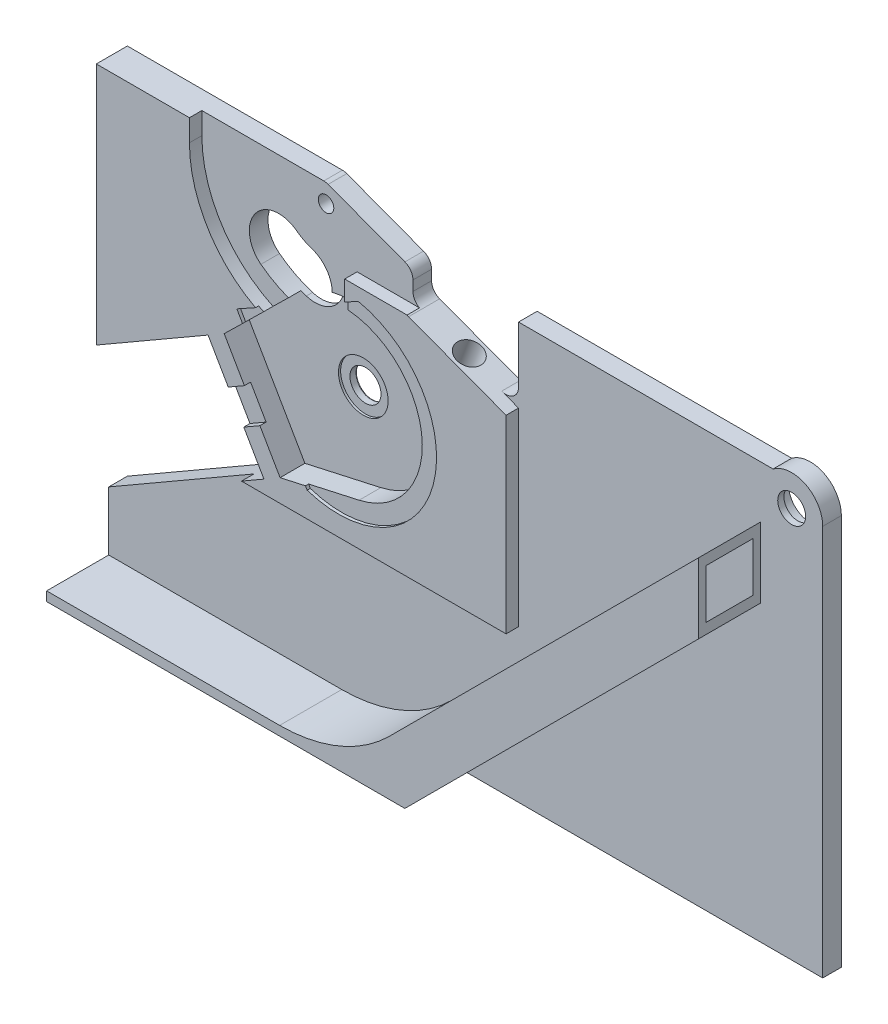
from build123d import *

# Parameters (mm, degrees)
BOSS_EXTRU_1_DEPTH       = 3
BOSS_EXTRU_2_DEPTH       = 10
ESQUISSE3_W              = 7.6
ESQUISSE3_H              = 5.6
ENL_V_MAT_EXTRU_1_DEPTH  = 50
ENL_V_MAT_EXTRU_2_DEPTH  = 7.6
ENL_V_MAT_EXTRU_3_DEPTH  = 10
BOSS_EXTRU_4_DEPTH       = 2
ESQUISSE10_R             = 2.5
ENL_V_MAT_EXTRU_5_DEPTH  = 136.388330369
ENL_V_MAT_EXTRU_6_DEPTH  = 2
TROU_TARAUD_M31_D        = 2.5
ENL_V_MAT_EXTRU_7_DEPTH  = 10
ENL_V_MAT_EXTRU_9_DEPTH  = 10
CONG_3_R                 = 2
ENL_V_MAT_EXTRU_10_DEPTH = 4
ESQUISSE23_R             = 4
ESQUISSE23_R_2           = 2.5
ENL_V_MAT_EXTRU_14_DEPTH = 0.35
ESQUISSE24_R             = 7
ESQUISSE24_R_2           = 2.5
BOSS_EXTRU_7_DEPTH       = 0.5
CONG_4_R                 = 0.2
ESQUISSE27_R             = 5
BOSS_EXTRU_8_DEPTH       = 3
ESQUISSE28_R             = 3.5
ENL_V_MAT_EXTRU_16_DEPTH = 2
ESQUISSE29_R             = 2.25
ENL_V_MAT_EXTRU_17_DEPTH = 2
ENL_V_MAT_EXTRU_18_DEPTH = 136.775550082
ENL_V_MAT_EXTRU_24_DEPTH = 0.5
ESQUISSE37_R             = 2
ENL_V_MAT_EXTRU_25_DEPTH = 6
ENL_V_MAT_EXTRU_26_DEPTH = 1


with BuildPart() as part:
    # Esquisse1 → Boss.-Extru.1 (new body)
    with BuildSketch(Plane.XY):
        Polygon((0, 0), (115, 0), (115, 67), (60, 67), (60, 71), (0, 71), (0, 67), align=None)
    extrude(amount=BOSS_EXTRU_1_DEPTH)

    # Esquisse2 → Boss.-Extru.2 (add)
    with BuildSketch(Plane.XY.offset(3)):
        with BuildLine():
            Line((105, 58.613708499), (105, 47.3))
            Line((105, 47.3), (57.7, 0))
            Line((57.7, 0), (49.300505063, 0))
            Line((49.300505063, 0), (0, 0))
            Line((0, 0), (0, 1.5))
            Line((0, 1.5), (37.530952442, 1.5))
            ThreePointArc((37.530952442, 1.5), (47.098038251, 3.403011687), (55.208621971, 8.82233047))
            Line((55.208621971, 8.82233047), (105, 58.613708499))
        make_face()
    extrude(amount=BOSS_EXTRU_2_DEPTH)

    # Esquisse3 → Enl_v. mat.-Extru.1 (cut, symmetric)
    with BuildSketch(Plane(origin=(112.071067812, 2.928932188, 0), x_dir=(0, 0, -1), z_dir=(0.7071067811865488, 0.7071067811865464, 0))):
        with Locations((-8, 40.375082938)):
            Rectangle(ESQUISSE3_W, ESQUISSE3_H)
    extrude(amount=ENL_V_MAT_EXTRU_1_DEPTH, both=True, mode=Mode.SUBTRACT)

    # Esquisse5 → Enl_v. mat.-Extru.2 (cut)
    with BuildSketch(Plane.XY.offset(4.2)):
        with BuildLine():
            Line((55.405678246, 7.32233047), (48.083347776, 0))
            Line((48.083347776, 0), (37.728008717, 0))
            ThreePointArc((37.728008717, 0), (47.295094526, 1.903011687), (55.405678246, 7.32233047))
        make_face()
    extrude(amount=ENL_V_MAT_EXTRU_2_DEPTH, mode=Mode.SUBTRACT)

    # Esquisse6 → Enl_v. mat.-Extru.3 (cut)
    with BuildSketch(Plane.XY.offset(3)):
        Polygon((0, 11), (27, 26.588457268), (18, 42.176914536), (0, 31.784609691), align=None)
    extrude(amount=-ENL_V_MAT_EXTRU_3_DEPTH, mode=Mode.SUBTRACT)

    # Esquisse7 → Boss.-Extru.4 (add)
    with BuildSketch(Plane.XY.offset(3)):
        Polygon((23.382685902, 24.5), (66, 24.5), (66, 55), (50, 61), (21, 61), (21, 71), (0, 71), (0, 60), (0, 31.784609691), (18, 42.176914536), (27, 26.588457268), align=None)
    extrude(amount=BOSS_EXTRU_4_DEPTH)

    # Esquisse10 → Enl_v. mat.-Extru.5 (cut, through all)
    with BuildSketch(Plane.XY.offset(5)):
        with Locations((39, 43.5)):
            Circle(ESQUISSE10_R)
    extrude(amount=-ENL_V_MAT_EXTRU_5_DEPTH, mode=Mode.SUBTRACT)

    # Esquisse13 → Enl_v. mat.-Extru.6 (cut)
    with BuildSketch(Plane.XY.offset(5)):
        with BuildLine():
            Line((40, 71), (40, 48.135083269))
            ThreePointArc((40, 48.135083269), (22.752551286, 51.688611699), (15, 67.5))
            Line((15, 67.5), (15, 71))
            Line((15, 71), (40, 71))
        make_face()
    extrude(amount=-ENL_V_MAT_EXTRU_6_DEPTH, mode=Mode.SUBTRACT)

    # Trou taraud_ M31 (through all)
    with Locations(Plane.XY.offset(3)):
        with Locations((35, 68)):
            Hole(TROU_TARAUD_M31_D / 2)

    # Esquisse18 → Enl_v. mat.-Extru.7 (cut)
    with BuildSketch(Plane.XY.offset(3)):
        with BuildLine():
            ThreePointArc((24.508994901, 54.306888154), (27.04616076, 52.693173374), (29.825, 51.544548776))
            ThreePointArc((29.825, 51.544548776), (35.781211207, 54.650759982), (32.675, 60.606971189))
            ThreePointArc((32.675, 60.606971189), (31.426535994, 61.123019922), (30.286649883, 61.848022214))
            ThreePointArc((30.286649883, 61.848022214), (23.627255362, 60.966282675), (24.508994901, 54.306888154))
        make_face()
    extrude(amount=-ENL_V_MAT_EXTRU_7_DEPTH, mode=Mode.SUBTRACT)

    # Esquisse19 → Enl_v. mat.-Extru.9 (cut)
    with BuildSketch(Plane(origin=(0, 0, 0), x_dir=(-1, 0, 0), z_dir=(0, 0, -1))):
        Polygon((-66, 71), (-66, 55), (-49, 61.375), (-49, 65.75), (-35, 71), align=None)
    extrude(amount=-ENL_V_MAT_EXTRU_9_DEPTH, mode=Mode.SUBTRACT)

    # Cong_3
    cong_3_edges = [part.edges().sort_by_distance(p)[0] for p in [
        (35, 71, 1.5),
        (49, 65.75, 1.5),
        (49, 61.375, 1.5),
        (66, 55, 1.5),
    ]]
    fillet(cong_3_edges, radius=CONG_3_R)

    # Esquisse20 → Enl_v. mat.-Extru.10 (cut)
    with BuildSketch(Plane.XY.offset(5)):
        with BuildLine():
            Line((20.598076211, 43.676914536), (29.598076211, 28.088457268))
            Line((29.598076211, 28.088457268), (41.825146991, 30.810691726))
            ThreePointArc((41.825146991, 30.810691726), (50.427609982, 49.697558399), (29.905483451, 52.789228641))
            Line((29.905483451, 52.789228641), (20.598076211, 43.676914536))
        make_face()
    extrude(amount=-ENL_V_MAT_EXTRU_10_DEPTH, mode=Mode.SUBTRACT)

    # Esquisse23 → Enl_v. mat.-Extru.14 (cut)
    with BuildSketch(Plane.XY.offset(1)):
        with Locations((39, 43.5)):
            Circle(ESQUISSE23_R)
        with Locations((39, 43.5)):
            Circle(ESQUISSE23_R_2, mode=Mode.SUBTRACT)
    extrude(amount=-ENL_V_MAT_EXTRU_14_DEPTH, mode=Mode.SUBTRACT)

    # Esquisse24 → Boss.-Extru.7 (add)
    with BuildSketch(Plane(origin=(0, 0, 0), x_dir=(-1, 0, 0), z_dir=(0, 0, -1))):
        with Locations((-39, 43.5)):
            Circle(ESQUISSE24_R)
        with Locations(Location((-39, 43.5, 0), (0, 0, 180))):
            Circle(ESQUISSE24_R_2, mode=Mode.SUBTRACT)
    extrude(amount=BOSS_EXTRU_7_DEPTH)

    # Cong_4
    cong_4_edges = [part.edges().sort_by_distance(p)[0] for p in [
        (46, 43.5, -0.5),
        (36.5, 43.5, -0.5),
    ]]
    fillet(cong_4_edges, radius=CONG_4_R)

    # Esquisse27 → Boss.-Extru.8 (add)
    with BuildSketch(Plane(origin=(0, 0, 0), x_dir=(-1, 0, 0), z_dir=(0, 0, -1))):
        with Locations((-110, 63)):
            Circle(ESQUISSE27_R)
    extrude(amount=-BOSS_EXTRU_8_DEPTH)

    # Esquisse28 → Enl_v. mat.-Extru.16 (cut)
    with BuildSketch(Plane(origin=(0, 0, 0), x_dir=(-1, 0, 0), z_dir=(0, 0, -1))):
        with Locations((-110, 63)):
            Circle(ESQUISSE28_R)
    extrude(amount=-ENL_V_MAT_EXTRU_16_DEPTH, mode=Mode.SUBTRACT)

    # Esquisse29 → Enl_v. mat.-Extru.17 (cut)
    with BuildSketch(Plane(origin=(0, 0, 2), x_dir=(-1, 0, 0), z_dir=(0, 0, -1))):
        with Locations((-110, 63)):
            Circle(ESQUISSE29_R)
    extrude(amount=-ENL_V_MAT_EXTRU_17_DEPTH, mode=Mode.SUBTRACT)

    # Esquisse30 → Enl_v. mat.-Extru.18 (cut, through all)
    with BuildSketch(Plane(origin=(0, 0, 0), x_dir=(-1, 0, 0), z_dir=(0, 0, -1))):
        with BuildLine():
            Line((-113, 67), (-115, 67))
            Line((-115, 67), (-115, 63))
            ThreePointArc((-115, 63), (-114.472135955, 65.236067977), (-113, 67))
        make_face()
    extrude(amount=-ENL_V_MAT_EXTRU_18_DEPTH, mode=Mode.SUBTRACT)

    # Esquisse36 → Enl_v. mat.-Extru.24 (cut)
    with BuildSketch(Plane.XY.offset(5)):
        with BuildLine():
            Line((42.178843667, 58.976916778), (22.632178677, 48.153745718))
            Line((22.632178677, 48.153745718), (33.965714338, 28.523486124))
            ThreePointArc((33.965714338, 28.523486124), (54.254950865, 39.38582036), (42.178843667, 58.976916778))
        make_face()
    extrude(amount=-ENL_V_MAT_EXTRU_24_DEPTH, mode=Mode.SUBTRACT)

    # Esquisse37 → Enl_v. mat.-Extru.25 (cut)
    with BuildSketch(Plane(origin=(26.219178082, 69.917808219, 0), x_dir=(0.9363291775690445, -0.3511234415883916, 0), z_dir=(0.3511234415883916, 0.9363291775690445, 0))):
        with Locations(Location((33.485936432, -2.5, 0), (0, 0, 180))):
            Circle(ESQUISSE37_R)
    extrude(amount=-ENL_V_MAT_EXTRU_25_DEPTH, mode=Mode.SUBTRACT)

    # Esquisse38 → Enl_v. mat.-Extru.26 (cut)
    with BuildSketch(Plane.XY.offset(5)):
        Polygon((21.25, 36.547749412), (23.848076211, 38.047749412), (26.348076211, 33.717622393), (23.75, 32.217622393), align=None)
    extrude(amount=-ENL_V_MAT_EXTRU_26_DEPTH, mode=Mode.SUBTRACT)


solid = part.part
